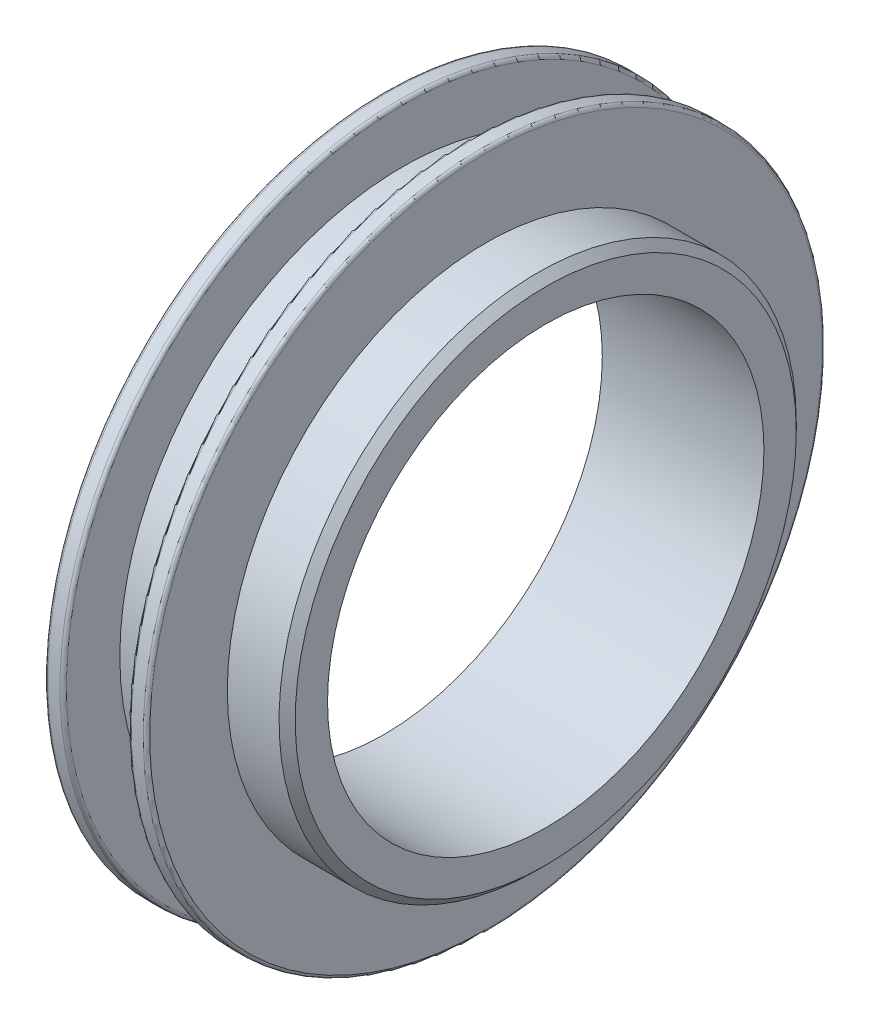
ISO-10303-21;
HEADER;
FILE_DESCRIPTION(('STEP AP214'),'2;1');
FILE_NAME('part.step','',(''),(''),'','','');
FILE_SCHEMA(('AUTOMOTIVE_DESIGN { 1 0 10303 214 1 1 1 1 }'));
ENDSEC;
DATA;
#1=APPLICATION_CONTEXT('core data for automotive mechanical design processes');
#2=APPLICATION_PROTOCOL_DEFINITION('international standard','automotive_design',2000,#1);
#3=PRODUCT_CONTEXT('',#1,'mechanical');
#4=PRODUCT('Part','Part','',(#3));
#5=PRODUCT_RELATED_PRODUCT_CATEGORY('part','',(#4));
#6=PRODUCT_DEFINITION_FORMATION('','',#4);
#7=PRODUCT_DEFINITION_CONTEXT('part definition',#1,'design');
#8=PRODUCT_DEFINITION('design','',#6,#7);
#9=PRODUCT_DEFINITION_SHAPE('','',#8);
#10=(LENGTH_UNIT() NAMED_UNIT(*) SI_UNIT(.MILLI.,.METRE.));
#11=(NAMED_UNIT(*) PLANE_ANGLE_UNIT() SI_UNIT($,.RADIAN.));
#12=(NAMED_UNIT(*) SI_UNIT($,.STERADIAN.) SOLID_ANGLE_UNIT());
#13=UNCERTAINTY_MEASURE_WITH_UNIT(LENGTH_MEASURE(1.E-05),#10,'distance_accuracy_value','');
#14=(GEOMETRIC_REPRESENTATION_CONTEXT(3) GLOBAL_UNCERTAINTY_ASSIGNED_CONTEXT((#13)) GLOBAL_UNIT_ASSIGNED_CONTEXT((#10,
#11,#12)) REPRESENTATION_CONTEXT('',''));
#15=CARTESIAN_POINT('',(0.,0.,0.));
#16=DIRECTION('',(0.,0.,1.));
#17=DIRECTION('',(1.,0.,0.));
#18=AXIS2_PLACEMENT_3D('',#15,#16,#17);
#19=CARTESIAN_POINT('',(-0.500000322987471,0.,0.));
#20=DIRECTION('',(-1.,0.,0.));
#21=DIRECTION('',(0.,0.,0.999999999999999));
#22=AXIS2_PLACEMENT_3D('',#19,#20,#21);
#23=CONICAL_SURFACE('',#22,16.0000018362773,0.785398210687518);
#24=CARTESIAN_POINT('',(-0.500002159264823,0.,0.));
#25=DIRECTION('',(1.,0.,0.));
#26=DIRECTION('',(0.,-1.,0.));
#27=AXIS2_PLACEMENT_3D('',#24,#25,#26);
#28=CIRCLE('',#27,16.);
#29=CARTESIAN_POINT('',(-0.500002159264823,-16.,0.));
#30=VERTEX_POINT('',#29);
#31=EDGE_CURVE('E75',#30,#30,#28,.F.);
#32=ORIENTED_EDGE('',*,*,#31,.F.);
#33=EDGE_LOOP('',(#32));
#34=FACE_BOUND('',#33,.T.);
#35=CARTESIAN_POINT('',(0.,0.,0.));
#36=DIRECTION('',(1.,0.,0.));
#37=DIRECTION('',(0.,0.,-0.999999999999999));
#38=AXIS2_PLACEMENT_3D('',#35,#36,#37);
#39=CIRCLE('',#38,15.5000014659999);
#40=CARTESIAN_POINT('',(0.,0.,-15.5000014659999));
#41=VERTEX_POINT('',#40);
#42=EDGE_CURVE('E247',#41,#41,#39,.T.);
#43=ORIENTED_EDGE('',*,*,#42,.F.);
#44=EDGE_LOOP('',(#43));
#45=FACE_BOUND('',#44,.T.);
#46=ADVANCED_FACE('F14',(#34,#45),#23,.T.);
#47=CARTESIAN_POINT('',(-3.70000000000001,0.,0.));
#48=DIRECTION('',(1.,0.,0.));
#49=DIRECTION('',(0.,0.,-0.999999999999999));
#50=AXIS2_PLACEMENT_3D('',#47,#48,#49);
#51=CYLINDRICAL_SURFACE('',#50,16.);
#52=CARTESIAN_POINT('',(-3.70000000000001,0.,0.));
#53=DIRECTION('',(1.,0.,0.));
#54=DIRECTION('',(0.,0.,-0.999999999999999));
#55=AXIS2_PLACEMENT_3D('',#52,#53,#54);
#56=CIRCLE('',#55,16.);
#57=CARTESIAN_POINT('',(-3.70000000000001,0.,-16.));
#58=VERTEX_POINT('',#57);
#59=EDGE_CURVE('E245',#58,#58,#56,.T.);
#60=ORIENTED_EDGE('',*,*,#59,.T.);
#61=EDGE_LOOP('',(#60));
#62=FACE_BOUND('',#61,.T.);
#63=ORIENTED_EDGE('',*,*,#31,.T.);
#64=EDGE_LOOP('',(#63));
#65=FACE_BOUND('',#64,.T.);
#66=ADVANCED_FACE('F254',(#62,#65),#51,.T.);
#67=CARTESIAN_POINT('',(0.,0.,0.));
#68=DIRECTION('',(1.,0.,0.));
#69=DIRECTION('',(0.,0.,-0.999999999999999));
#70=AXIS2_PLACEMENT_3D('',#67,#68,#69);
#71=PLANE('',#70);
#72=CARTESIAN_POINT('',(0.,0.,0.));
#73=DIRECTION('',(1.,0.,0.));
#74=DIRECTION('',(0.,0.,-0.999999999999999));
#75=AXIS2_PLACEMENT_3D('',#72,#73,#74);
#76=CIRCLE('',#75,13.5);
#77=CARTESIAN_POINT('',(0.,0.,-13.5));
#78=VERTEX_POINT('',#77);
#79=EDGE_CURVE('E62',#78,#78,#76,.F.);
#80=ORIENTED_EDGE('',*,*,#79,.T.);
#81=EDGE_LOOP('',(#80));
#82=FACE_BOUND('',#81,.T.);
#83=ORIENTED_EDGE('',*,*,#42,.T.);
#84=EDGE_LOOP('',(#83));
#85=FACE_BOUND('',#84,.T.);
#86=ADVANCED_FACE('F263',(#82,#85),#71,.T.);
#87=CARTESIAN_POINT('',(-3.70000000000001,0.,0.));
#88=DIRECTION('',(-1.,0.,0.));
#89=DIRECTION('',(0.,0.,0.999999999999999));
#90=AXIS2_PLACEMENT_3D('',#87,#88,#89);
#91=PLANE('',#90);
#92=ORIENTED_EDGE('',*,*,#59,.F.);
#93=EDGE_LOOP('',(#92));
#94=FACE_BOUND('',#93,.T.);
#95=CARTESIAN_POINT('',(-3.70000000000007,0.,0.));
#96=DIRECTION('',(-1.,0.,0.));
#97=DIRECTION('',(0.,1.,0.));
#98=AXIS2_PLACEMENT_3D('',#95,#96,#97);
#99=CIRCLE('',#98,20.80000000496);
#100=CARTESIAN_POINT('',(-3.70000000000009,20.800000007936,0.));
#101=VERTEX_POINT('',#100);
#102=CARTESIAN_POINT('',(-3.70000000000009,-20.800000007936,0.));
#103=VERTEX_POINT('',#102);
#104=EDGE_CURVE('E60',#101,#103,#99,.T.);
#105=ORIENTED_EDGE('',*,*,#104,.F.);
#106=CARTESIAN_POINT('',(-3.70000000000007,0.,0.));
#107=DIRECTION('',(-1.,0.,0.));
#108=DIRECTION('',(0.,-1.,0.));
#109=AXIS2_PLACEMENT_3D('',#106,#107,#108);
#110=CIRCLE('',#109,20.80000000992);
#111=EDGE_CURVE('E55',#103,#101,#110,.T.);
#112=ORIENTED_EDGE('',*,*,#111,.F.);
#113=EDGE_LOOP('',(#105,#112));
#114=FACE_BOUND('',#113,.T.);
#115=ADVANCED_FACE('F59',(#94,#114),#91,.F.);
#116=CARTESIAN_POINT('',(-10.0000000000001,0.,0.));
#117=DIRECTION('',(1.,0.,0.));
#118=DIRECTION('',(0.,0.,-0.999999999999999));
#119=AXIS2_PLACEMENT_3D('',#116,#117,#118);
#120=CYLINDRICAL_SURFACE('',#119,13.5);
#121=CARTESIAN_POINT('',(-10.0000000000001,0.,0.));
#122=DIRECTION('',(1.,0.,0.));
#123=DIRECTION('',(0.,0.,-0.999999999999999));
#124=AXIS2_PLACEMENT_3D('',#121,#122,#123);
#125=CIRCLE('',#124,13.5);
#126=CARTESIAN_POINT('',(-10.0000000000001,0.,-13.5));
#127=VERTEX_POINT('',#126);
#128=EDGE_CURVE('E67',#127,#127,#125,.F.);
#129=ORIENTED_EDGE('',*,*,#128,.T.);
#130=EDGE_LOOP('',(#129));
#131=FACE_BOUND('',#130,.T.);
#132=ORIENTED_EDGE('',*,*,#79,.F.);
#133=EDGE_LOOP('',(#132));
#134=FACE_BOUND('',#133,.T.);
#135=ADVANCED_FACE('F87',(#131,#134),#120,.F.);
#136=CARTESIAN_POINT('',(-3.90000000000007,0.,0.));
#137=DIRECTION('',(-1.,0.,0.));
#138=DIRECTION('',(0.,-0.999980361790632,0.00626705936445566));
#139=AXIS2_PLACEMENT_3D('',#136,#137,#138);
#140=TOROIDAL_SURFACE('',#139,20.8,0.2);
#141=CARTESIAN_POINT('',(-3.9000000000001,0.,0.));
#142=DIRECTION('',(-1.,0.,0.));
#143=DIRECTION('',(0.,-1.,0.));
#144=AXIS2_PLACEMENT_3D('',#141,#142,#143);
#145=CIRCLE('',#144,21.);
#146=CARTESIAN_POINT('',(-3.9000000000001,-21.,0.));
#147=VERTEX_POINT('',#146);
#148=EDGE_CURVE('E70',#147,#147,#145,.T.);
#149=ORIENTED_EDGE('',*,*,#148,.F.);
#150=EDGE_LOOP('',(#149));
#151=FACE_BOUND('',#150,.T.);
#152=ORIENTED_EDGE('',*,*,#104,.T.);
#153=ORIENTED_EDGE('',*,*,#111,.T.);
#154=EDGE_LOOP('',(#152,#153));
#155=FACE_BOUND('',#154,.T.);
#156=ADVANCED_FACE('F66',(#151,#155),#140,.T.);
#157=CARTESIAN_POINT('',(-10.0000000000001,0.,0.));
#158=DIRECTION('',(1.,0.,0.));
#159=DIRECTION('',(0.,0.,-0.999999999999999));
#160=AXIS2_PLACEMENT_3D('',#157,#158,#159);
#161=PLANE('',#160);
#162=ORIENTED_EDGE('',*,*,#128,.F.);
#163=EDGE_LOOP('',(#162));
#164=FACE_BOUND('',#163,.T.);
#165=CARTESIAN_POINT('',(-10.0000000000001,0.,0.));
#166=DIRECTION('',(1.,0.,0.));
#167=DIRECTION('',(0.,-1.,0.));
#168=AXIS2_PLACEMENT_3D('',#165,#166,#167);
#169=CIRCLE('',#168,20.80000000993);
#170=CARTESIAN_POINT('',(-10.0000000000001,-20.800000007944,0.));
#171=VERTEX_POINT('',#170);
#172=CARTESIAN_POINT('',(-10.0000000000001,20.800000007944,0.));
#173=VERTEX_POINT('',#172);
#174=EDGE_CURVE('E100',#171,#173,#169,.T.);
#175=ORIENTED_EDGE('',*,*,#174,.F.);
#176=CARTESIAN_POINT('',(-10.0000000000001,0.,0.));
#177=DIRECTION('',(1.,0.,0.));
#178=DIRECTION('',(0.,1.,0.));
#179=AXIS2_PLACEMENT_3D('',#176,#177,#178);
#180=CIRCLE('',#179,20.800000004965);
#181=EDGE_CURVE('E111',#173,#171,#180,.T.);
#182=ORIENTED_EDGE('',*,*,#181,.F.);
#183=EDGE_LOOP('',(#175,#182));
#184=FACE_BOUND('',#183,.T.);
#185=ADVANCED_FACE('F86',(#164,#184),#161,.F.);
#186=CARTESIAN_POINT('',(-3.9000000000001,0.,0.));
#187=DIRECTION('',(-1.,0.,0.));
#188=DIRECTION('',(0.,0.,0.999999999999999));
#189=AXIS2_PLACEMENT_3D('',#186,#187,#188);
#190=CYLINDRICAL_SURFACE('',#189,21.);
#191=ORIENTED_EDGE('',*,*,#148,.T.);
#192=EDGE_LOOP('',(#191));
#193=FACE_BOUND('',#192,.T.);
#194=CARTESIAN_POINT('',(-4.6500000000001,0.,0.));
#195=DIRECTION('',(-1.,0.,0.));
#196=DIRECTION('',(0.,-0.999991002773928,0.00424197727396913));
#197=AXIS2_PLACEMENT_3D('',#194,#195,#196);
#198=CIRCLE('',#197,21.);
#199=CARTESIAN_POINT('',(-4.6500000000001,-20.9998110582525,0.0890815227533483));
#200=VERTEX_POINT('',#199);
#201=EDGE_CURVE('E232',#200,#200,#198,.T.);
#202=ORIENTED_EDGE('',*,*,#201,.F.);
#203=EDGE_LOOP('',(#202));
#204=FACE_BOUND('',#203,.T.);
#205=ADVANCED_FACE('F130',(#193,#204),#190,.T.);
#206=CARTESIAN_POINT('',(-9.80000000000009,0.,0.));
#207=DIRECTION('',(-1.,0.,0.));
#208=DIRECTION('',(0.,-0.999990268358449,-0.00441171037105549));
#209=AXIS2_PLACEMENT_3D('',#206,#207,#208);
#210=TOROIDAL_SURFACE('',#209,20.8,0.2);
#211=CARTESIAN_POINT('',(-9.80000000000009,0.,0.));
#212=DIRECTION('',(-1.,0.,0.));
#213=DIRECTION('',(0.,-1.,0.));
#214=AXIS2_PLACEMENT_3D('',#211,#212,#213);
#215=CIRCLE('',#214,21.);
#216=CARTESIAN_POINT('',(-9.80000000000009,-21.,0.));
#217=VERTEX_POINT('',#216);
#218=EDGE_CURVE('E224',#217,#217,#215,.F.);
#219=ORIENTED_EDGE('',*,*,#218,.F.);
#220=EDGE_LOOP('',(#219));
#221=FACE_BOUND('',#220,.T.);
#222=ORIENTED_EDGE('',*,*,#181,.T.);
#223=ORIENTED_EDGE('',*,*,#174,.T.);
#224=EDGE_LOOP('',(#222,#223));
#225=FACE_BOUND('',#224,.T.);
#226=ADVANCED_FACE('F125',(#221,#225),#210,.T.);
#227=CARTESIAN_POINT('',(-4.6500000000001,0.,0.));
#228=DIRECTION('',(-1.,0.,0.));
#229=DIRECTION('',(0.,-0.999991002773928,0.00424197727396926));
#230=AXIS2_PLACEMENT_3D('',#227,#228,#229);
#231=TOROIDAL_SURFACE('',#230,20.8,0.2);
#232=CARTESIAN_POINT('',(-4.8500000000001,0.,0.));
#233=DIRECTION('',(1.,0.,0.));
#234=DIRECTION('',(0.,1.,0.));
#235=AXIS2_PLACEMENT_3D('',#232,#233,#234);
#236=CIRCLE('',#235,20.80000003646);
#237=CARTESIAN_POINT('',(-4.85000000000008,-20.800000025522,0.));
#238=VERTEX_POINT('',#237);
#239=CARTESIAN_POINT('',(-4.85000000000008,20.800000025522,0.));
#240=VERTEX_POINT('',#239);
#241=EDGE_CURVE('E161',#238,#240,#236,.F.);
#242=ORIENTED_EDGE('',*,*,#241,.F.);
#243=CARTESIAN_POINT('',(-4.8500000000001,0.,0.));
#244=DIRECTION('',(1.,0.,0.));
#245=DIRECTION('',(0.,-1.,0.));
#246=AXIS2_PLACEMENT_3D('',#243,#244,#245);
#247=CIRCLE('',#246,20.80000001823);
#248=EDGE_CURVE('E219',#240,#238,#247,.F.);
#249=ORIENTED_EDGE('',*,*,#248,.F.);
#250=EDGE_LOOP('',(#242,#249));
#251=FACE_BOUND('',#250,.T.);
#252=ORIENTED_EDGE('',*,*,#201,.T.);
#253=EDGE_LOOP('',(#252));
#254=FACE_BOUND('',#253,.T.);
#255=ADVANCED_FACE('F129',(#251,#254),#231,.T.);
#256=CARTESIAN_POINT('',(-9.05000000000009,0.,0.));
#257=DIRECTION('',(-1.,0.,0.));
#258=DIRECTION('',(0.,0.,0.999999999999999));
#259=AXIS2_PLACEMENT_3D('',#256,#257,#258);
#260=CYLINDRICAL_SURFACE('',#259,21.);
#261=CARTESIAN_POINT('',(-9.05000000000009,0.,0.));
#262=DIRECTION('',(-1.,0.,0.));
#263=DIRECTION('',(0.,-0.999989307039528,-0.00462447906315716));
#264=AXIS2_PLACEMENT_3D('',#261,#262,#263);
#265=CIRCLE('',#264,21.);
#266=CARTESIAN_POINT('',(-9.05000000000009,-20.9997754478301,-0.0971140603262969));
#267=VERTEX_POINT('',#266);
#268=EDGE_CURVE('E210',#267,#267,#265,.F.);
#269=ORIENTED_EDGE('',*,*,#268,.F.);
#270=EDGE_LOOP('',(#269));
#271=FACE_BOUND('',#270,.T.);
#272=ORIENTED_EDGE('',*,*,#218,.T.);
#273=EDGE_LOOP('',(#272));
#274=FACE_BOUND('',#273,.T.);
#275=ADVANCED_FACE('F280',(#271,#274),#260,.T.);
#276=CARTESIAN_POINT('',(-4.85000000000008,0.,0.));
#277=DIRECTION('',(-1.,0.,0.));
#278=DIRECTION('',(0.,0.,0.999999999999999));
#279=AXIS2_PLACEMENT_3D('',#276,#277,#278);
#280=PLANE('',#279);
#281=CARTESIAN_POINT('',(-4.85000000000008,0.,0.));
#282=DIRECTION('',(-1.,0.,0.));
#283=DIRECTION('',(0.,0.,0.999999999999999));
#284=AXIS2_PLACEMENT_3D('',#281,#282,#283);
#285=CIRCLE('',#284,17.5);
#286=CARTESIAN_POINT('',(-4.85000000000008,0.,17.5));
#287=VERTEX_POINT('',#286);
#288=EDGE_CURVE('E218',#287,#287,#285,.T.);
#289=ORIENTED_EDGE('',*,*,#288,.F.);
#290=EDGE_LOOP('',(#289));
#291=FACE_BOUND('',#290,.T.);
#292=ORIENTED_EDGE('',*,*,#241,.T.);
#293=ORIENTED_EDGE('',*,*,#248,.T.);
#294=EDGE_LOOP('',(#292,#293));
#295=FACE_BOUND('',#294,.T.);
#296=ADVANCED_FACE('F178',(#291,#295),#280,.T.);
#297=CARTESIAN_POINT('',(-9.05000000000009,0.,0.));
#298=DIRECTION('',(-1.,0.,0.));
#299=DIRECTION('',(0.,-0.999989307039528,-0.00462447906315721));
#300=AXIS2_PLACEMENT_3D('',#297,#298,#299);
#301=TOROIDAL_SURFACE('',#300,20.8,0.2);
#302=CARTESIAN_POINT('',(-8.85000000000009,0.,0.));
#303=DIRECTION('',(-1.,0.,0.));
#304=DIRECTION('',(0.,1.,0.));
#305=AXIS2_PLACEMENT_3D('',#302,#303,#304);
#306=CIRCLE('',#305,20.80000003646);
#307=CARTESIAN_POINT('',(-8.85000000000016,20.800000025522,0.));
#308=VERTEX_POINT('',#307);
#309=CARTESIAN_POINT('',(-8.85000000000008,-20.800000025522,0.));
#310=VERTEX_POINT('',#309);
#311=EDGE_CURVE('E190',#308,#310,#306,.T.);
#312=ORIENTED_EDGE('',*,*,#311,.T.);
#313=CARTESIAN_POINT('',(-8.85000000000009,0.,0.));
#314=DIRECTION('',(-1.,0.,0.));
#315=DIRECTION('',(0.,-1.,0.));
#316=AXIS2_PLACEMENT_3D('',#313,#314,#315);
#317=CIRCLE('',#316,20.80000001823);
#318=EDGE_CURVE('E27',#310,#308,#317,.T.);
#319=ORIENTED_EDGE('',*,*,#318,.T.);
#320=EDGE_LOOP('',(#312,#319));
#321=FACE_BOUND('',#320,.T.);
#322=ORIENTED_EDGE('',*,*,#268,.T.);
#323=EDGE_LOOP('',(#322));
#324=FACE_BOUND('',#323,.T.);
#325=ADVANCED_FACE('F167',(#321,#324),#301,.T.);
#326=CARTESIAN_POINT('',(-4.85000000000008,0.,0.));
#327=DIRECTION('',(-1.,0.,0.));
#328=DIRECTION('',(0.,0.,0.999999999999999));
#329=AXIS2_PLACEMENT_3D('',#326,#327,#328);
#330=CYLINDRICAL_SURFACE('',#329,17.5);
#331=CARTESIAN_POINT('',(-8.85000000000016,0.,0.));
#332=DIRECTION('',(-1.,0.,0.));
#333=DIRECTION('',(0.,0.,0.999999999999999));
#334=AXIS2_PLACEMENT_3D('',#331,#332,#333);
#335=CIRCLE('',#334,17.5);
#336=CARTESIAN_POINT('',(-8.85000000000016,0.,17.5));
#337=VERTEX_POINT('',#336);
#338=EDGE_CURVE('E9',#337,#337,#335,.F.);
#339=ORIENTED_EDGE('',*,*,#338,.T.);
#340=EDGE_LOOP('',(#339));
#341=FACE_BOUND('',#340,.T.);
#342=ORIENTED_EDGE('',*,*,#288,.T.);
#343=EDGE_LOOP('',(#342));
#344=FACE_BOUND('',#343,.T.);
#345=ADVANCED_FACE('F177',(#341,#344),#330,.T.);
#346=CARTESIAN_POINT('',(-8.85000000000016,0.,0.));
#347=DIRECTION('',(-1.,0.,0.));
#348=DIRECTION('',(0.,0.,0.999999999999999));
#349=AXIS2_PLACEMENT_3D('',#346,#347,#348);
#350=PLANE('',#349);
#351=ORIENTED_EDGE('',*,*,#338,.F.);
#352=EDGE_LOOP('',(#351));
#353=FACE_BOUND('',#352,.T.);
#354=ORIENTED_EDGE('',*,*,#311,.F.);
#355=ORIENTED_EDGE('',*,*,#318,.F.);
#356=EDGE_LOOP('',(#354,#355));
#357=FACE_BOUND('',#356,.T.);
#358=ADVANCED_FACE('F16',(#353,#357),#350,.F.);
#359=CLOSED_SHELL('',(#46,#66,#86,#115,#135,#156,#185,#205,#226,#255,#275,#296,#325,#345,#358));
#360=MANIFOLD_SOLID_BREP('B1',#359);
#361=ADVANCED_BREP_SHAPE_REPRESENTATION('',(#18,#360),#14);
#362=SHAPE_DEFINITION_REPRESENTATION(#9,#361);
ENDSEC;
END-ISO-10303-21;
